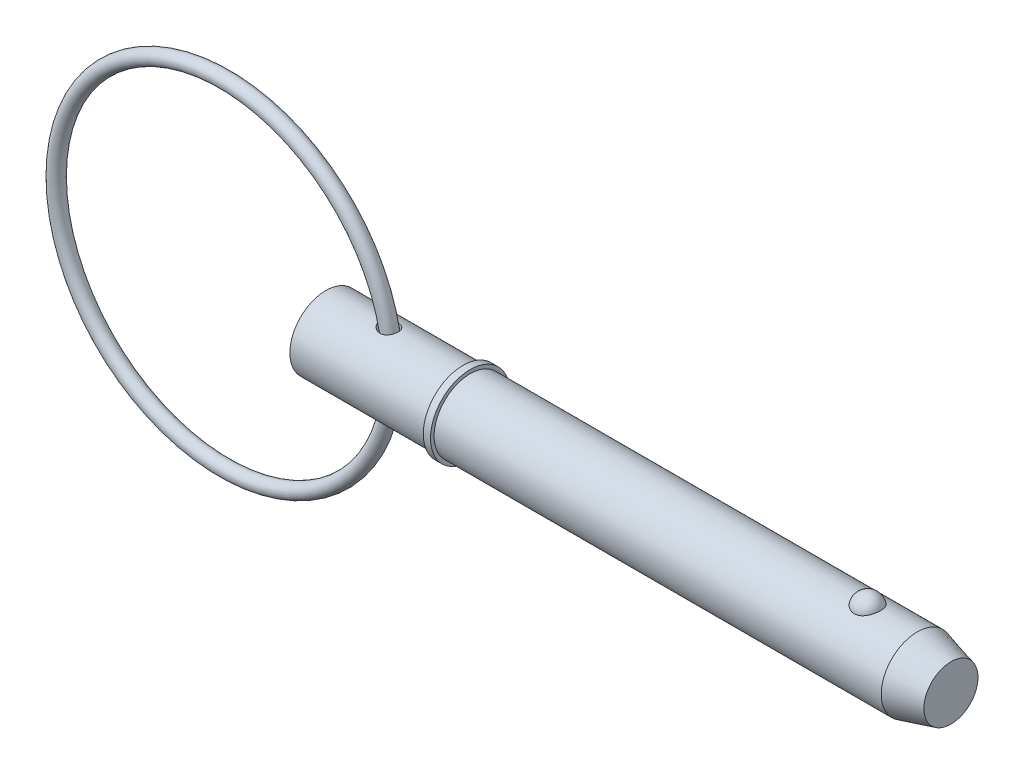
ISO-10303-21;
HEADER;
FILE_DESCRIPTION(('STEP AP214'),'2;1');
FILE_NAME('part.step','',(''),(''),'','','');
FILE_SCHEMA(('AUTOMOTIVE_DESIGN { 1 0 10303 214 1 1 1 1 }'));
ENDSEC;
DATA;
#1=APPLICATION_CONTEXT('core data for automotive mechanical design processes');
#2=APPLICATION_PROTOCOL_DEFINITION('international standard','automotive_design',2000,#1);
#3=PRODUCT_CONTEXT('',#1,'mechanical');
#4=PRODUCT('Part','Part','',(#3));
#5=PRODUCT_RELATED_PRODUCT_CATEGORY('part','',(#4));
#6=PRODUCT_DEFINITION_FORMATION('','',#4);
#7=PRODUCT_DEFINITION_CONTEXT('part definition',#1,'design');
#8=PRODUCT_DEFINITION('design','',#6,#7);
#9=PRODUCT_DEFINITION_SHAPE('','',#8);
#10=(LENGTH_UNIT() NAMED_UNIT(*) SI_UNIT(.MILLI.,.METRE.));
#11=(NAMED_UNIT(*) PLANE_ANGLE_UNIT() SI_UNIT($,.RADIAN.));
#12=(NAMED_UNIT(*) SI_UNIT($,.STERADIAN.) SOLID_ANGLE_UNIT());
#13=UNCERTAINTY_MEASURE_WITH_UNIT(LENGTH_MEASURE(1.E-05),#10,'distance_accuracy_value','');
#14=(GEOMETRIC_REPRESENTATION_CONTEXT(3) GLOBAL_UNCERTAINTY_ASSIGNED_CONTEXT((#13)) GLOBAL_UNIT_ASSIGNED_CONTEXT((#10,
#11,#12)) REPRESENTATION_CONTEXT('',''));
#15=CARTESIAN_POINT('',(0.,0.,0.));
#16=DIRECTION('',(0.,0.,1.));
#17=DIRECTION('',(1.,0.,0.));
#18=AXIS2_PLACEMENT_3D('',#15,#16,#17);
#19=CARTESIAN_POINT('',(-13.4013067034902,0.,0.));
#20=DIRECTION('',(0.,0.,1.));
#21=DIRECTION('',(1.,0.,0.));
#22=AXIS2_PLACEMENT_3D('',#19,#20,#21);
#23=TOROIDAL_SURFACE('',#22,22.225,0.952999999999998);
#24=CARTESIAN_POINT('',(9.77669329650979,0.,0.));
#25=VERTEX_POINT('',#24);
#26=VERTEX_LOOP('',#25);
#27=FACE_BOUND('',#26,.T.);
#28=ADVANCED_FACE('P0_F12',(#27),#23,.T.);
#29=CLOSED_SHELL('',(#28));
#30=MANIFOLD_SOLID_BREP('P0_B1',#29);
#31=CARTESIAN_POINT('',(0.,0.,0.));
#32=DIRECTION('',(1.,0.,0.));
#33=DIRECTION('',(0.,0.,-1.));
#34=AXIS2_PLACEMENT_3D('',#31,#32,#33);
#35=CYLINDRICAL_SURFACE('',#34,4.765);
#36=CARTESIAN_POINT('',(7.31773584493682,4.71580709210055,-0.682926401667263));
#37=CARTESIAN_POINT('',(7.3607471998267,4.70750812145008,-0.740230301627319));
#38=CARTESIAN_POINT('',(7.40883112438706,4.69869300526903,-0.79371122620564));
#39=CARTESIAN_POINT('',(7.51340999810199,4.68106981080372,-0.89180043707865));
#40=CARTESIAN_POINT('',(7.56991882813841,4.67226176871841,-0.936393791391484));
#41=CARTESIAN_POINT('',(7.689548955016,4.65568581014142,-1.01560363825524));
#42=CARTESIAN_POINT('',(7.75265928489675,4.64791621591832,-1.05023633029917));
#43=CARTESIAN_POINT('',(7.88387110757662,4.6343185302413,-1.10870278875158));
#44=CARTESIAN_POINT('',(7.95197058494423,4.62848966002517,-1.13254088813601));
#45=CARTESIAN_POINT('',(8.09209413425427,4.6194749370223,-1.16877415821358));
#46=CARTESIAN_POINT('',(8.16415141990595,4.6163169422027,-1.18104886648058));
#47=CARTESIAN_POINT('',(8.30937958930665,4.61324608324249,-1.19299123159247));
#48=CARTESIAN_POINT('',(8.38255011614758,4.61333220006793,-1.19266284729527));
#49=CARTESIAN_POINT('',(8.52374186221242,4.61674026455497,-1.17939593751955));
#50=CARTESIAN_POINT('',(8.59183022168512,4.61989017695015,-1.16712781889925));
#51=CARTESIAN_POINT('',(8.72470143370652,4.62884731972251,-1.13107903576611));
#52=CARTESIAN_POINT('',(8.78948513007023,4.63465386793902,-1.10730132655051));
#53=CARTESIAN_POINT('',(8.91088768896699,4.64792402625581,-1.05016249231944));
#54=CARTESIAN_POINT('',(8.96774302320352,4.65530108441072,-1.01728198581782));
#55=CARTESIAN_POINT('',(9.07499804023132,4.67102002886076,-0.942471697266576));
#56=CARTESIAN_POINT('',(9.12539777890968,4.6793619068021,-0.900541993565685));
#57=CARTESIAN_POINT('',(9.21836221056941,4.69607497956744,-0.808868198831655));
#58=CARTESIAN_POINT('',(9.26093651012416,4.70444612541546,-0.759133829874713));
#59=CARTESIAN_POINT('',(9.33728390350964,4.72032100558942,-0.653192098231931));
#60=CARTESIAN_POINT('',(9.3710564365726,4.72782468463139,-0.596984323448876));
#61=CARTESIAN_POINT('',(9.42940600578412,4.74126034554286,-0.478808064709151));
#62=CARTESIAN_POINT('',(9.45384681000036,4.74716869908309,-0.416769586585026));
#63=CARTESIAN_POINT('',(9.49226260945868,4.75663465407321,-0.289362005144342));
#64=CARTESIAN_POINT('',(9.50623742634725,4.76019221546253,-0.22399284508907));
#65=CARTESIAN_POINT('',(9.52342004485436,4.76458450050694,-0.0914886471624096));
#66=CARTESIAN_POINT('',(9.52658321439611,4.7654079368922,-0.0243474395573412));
#67=CARTESIAN_POINT('',(9.52194012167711,4.76421136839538,0.109528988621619));
#68=CARTESIAN_POINT('',(9.51413380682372,4.7621913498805,0.176264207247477));
#69=CARTESIAN_POINT('',(9.48775485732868,4.75552896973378,0.307367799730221));
#70=CARTESIAN_POINT('',(9.4691926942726,4.75088915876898,0.371738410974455));
#71=CARTESIAN_POINT('',(9.42175836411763,4.73949008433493,0.496364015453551));
#72=CARTESIAN_POINT('',(9.39288586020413,4.73273075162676,0.556618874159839));
#73=CARTESIAN_POINT('',(9.32549385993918,4.71782154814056,0.671371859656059));
#74=CARTESIAN_POINT('',(9.28696367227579,4.70967013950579,0.725863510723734));
#75=CARTESIAN_POINT('',(9.20123305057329,4.6928883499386,0.827453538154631));
#76=CARTESIAN_POINT('',(9.15403300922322,4.68425799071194,0.874552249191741));
#77=CARTESIAN_POINT('',(9.05250467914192,4.66754854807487,0.959736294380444));
#78=CARTESIAN_POINT('',(8.99822095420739,4.65946646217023,0.997874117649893));
#79=CARTESIAN_POINT('',(8.88381123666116,4.64472049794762,1.06440739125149));
#80=CARTESIAN_POINT('',(8.82368614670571,4.63805640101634,1.09280434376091));
#81=CARTESIAN_POINT('',(8.70022952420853,4.62698068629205,1.13878427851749));
#82=CARTESIAN_POINT('',(8.63695594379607,4.62253830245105,1.15651569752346));
#83=CARTESIAN_POINT('',(8.50825296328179,4.61622454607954,1.18146656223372));
#84=CARTESIAN_POINT('',(8.44282353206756,4.61435321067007,1.18868585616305));
#85=CARTESIAN_POINT('',(8.31119087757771,4.61332122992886,1.19268442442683));
#86=CARTESIAN_POINT('',(8.24498542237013,4.61417920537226,1.18939198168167));
#87=CARTESIAN_POINT('',(8.11397487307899,4.61847671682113,1.17259121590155));
#88=CARTESIAN_POINT('',(8.04917011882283,4.62191687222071,1.15908044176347));
#89=CARTESIAN_POINT('',(7.91946226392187,4.63117528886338,1.12153047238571));
#90=CARTESIAN_POINT('',(7.85470460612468,4.6371000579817,1.09701575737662));
#91=CARTESIAN_POINT('',(7.7300035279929,4.65063246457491,1.03814807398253));
#92=CARTESIAN_POINT('',(7.67006197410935,4.65824075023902,1.00379131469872));
#93=CARTESIAN_POINT('',(7.55352765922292,4.67473656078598,0.924015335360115));
#94=CARTESIAN_POINT('',(7.49726947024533,4.68366994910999,0.878115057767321));
#95=CARTESIAN_POINT('',(7.39344083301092,4.70144936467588,0.777311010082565));
#96=CARTESIAN_POINT('',(7.34587087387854,4.71029538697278,0.722406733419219));
#97=CARTESIAN_POINT('',(7.26188955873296,4.72669773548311,0.605773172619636));
#98=CARTESIAN_POINT('',(7.22531316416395,4.73427229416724,0.544165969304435));
#99=CARTESIAN_POINT('',(7.16406269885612,4.74732663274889,0.415095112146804));
#100=CARTESIAN_POINT('',(7.13937848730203,4.75280819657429,0.347636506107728));
#101=CARTESIAN_POINT('',(7.10494917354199,4.7605495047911,0.215359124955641));
#102=CARTESIAN_POINT('',(7.09405441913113,4.76305589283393,0.150853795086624));
#103=CARTESIAN_POINT('',(7.08387189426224,4.76539656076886,0.0208839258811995));
#104=CARTESIAN_POINT('',(7.0845805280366,4.76523166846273,-0.0445803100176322));
#105=CARTESIAN_POINT('',(7.09709111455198,4.76236014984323,-0.169693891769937));
#106=CARTESIAN_POINT('',(7.10810913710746,4.75983315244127,-0.229428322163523));
#107=CARTESIAN_POINT('',(7.13959099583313,4.75276726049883,-0.346187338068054));
#108=CARTESIAN_POINT('',(7.16004881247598,4.7482296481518,-0.403213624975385));
#109=CARTESIAN_POINT('',(7.20270325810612,4.73907067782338,-0.498040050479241));
#110=CARTESIAN_POINT('',(7.22286864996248,4.73481668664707,-0.536809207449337));
#111=CARTESIAN_POINT('',(7.26730952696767,4.72570777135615,-0.611832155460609));
#112=CARTESIAN_POINT('',(7.29158512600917,4.72085283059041,-0.64808587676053));
#113=CARTESIAN_POINT('',(7.31773584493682,4.71580709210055,-0.682926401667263));
#114=B_SPLINE_CURVE_WITH_KNOTS('',3,(#36,#37,#38,#39,#40,#41,#42,#43,#44,#45,#46,#47,#48,#49,
#50,#51,#52,#53,#54,#55,#56,#57,#58,#59,#60,#61,#62,#63,#64,#65,#66,#67,#68,#69,#70,#71,#72,#73,
#74,#75,#76,#77,#78,#79,#80,#81,#82,#83,#84,#85,#86,#87,#88,#89,#90,#91,#92,#93,#94,#95,#96,#97,
#98,#99,#100,#101,#102,#103,#104,#105,#106,#107,#108,#109,#110,#111,#112,#113),.UNSPECIFIED.,
.T.,.F.,(4,2,2,2,2,2,2,2,2,2,2,2,2,2,2,2,2,2,2,2,2,2,2,2,2,2,2,2,2,2,2,2,2,2,2,2,2,2,4),(0.,
0.216219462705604,0.432799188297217,0.649024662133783,0.865163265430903,1.08352938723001,
1.30182691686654,1.50853487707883,1.71518978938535,1.91252381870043,2.1098561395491,
2.30694457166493,2.50404555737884,2.70392296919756,2.90380378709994,3.10450875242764,
3.30521468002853,3.5057255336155,3.70624293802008,3.90698330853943,4.10771458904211,
4.30723900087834,4.50673262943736,4.70338139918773,4.90003300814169,5.09802914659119,
5.29607279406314,5.5036500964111,5.7113074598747,5.92972727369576,6.14815938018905,
6.36312650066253,6.57790998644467,6.77325899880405,6.96854747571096,7.15009726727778,
7.33153144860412,7.46298830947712,7.59444881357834),.UNSPECIFIED.);
#115=CARTESIAN_POINT('',(7.31773584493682,4.71580709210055,-0.682926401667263));
#116=VERTEX_POINT('',#115);
#117=EDGE_CURVE('P1_E42',#116,#116,#114,.T.);
#118=ORIENTED_EDGE('',*,*,#117,.T.);
#119=EDGE_LOOP('',(#118));
#120=FACE_BOUND('',#119,.T.);
#121=CARTESIAN_POINT('',(0.,0.,0.));
#122=DIRECTION('',(1.,0.,0.));
#123=DIRECTION('',(0.,0.,-1.));
#124=AXIS2_PLACEMENT_3D('',#121,#122,#123);
#125=CIRCLE('',#124,4.765);
#126=CARTESIAN_POINT('',(0.,0.,-4.765));
#127=VERTEX_POINT('',#126);
#128=EDGE_CURVE('P1_E9',#127,#127,#125,.T.);
#129=ORIENTED_EDGE('',*,*,#128,.T.);
#130=EDGE_LOOP('',(#129));
#131=FACE_BOUND('',#130,.T.);
#132=CARTESIAN_POINT('',(18.097,0.,0.));
#133=DIRECTION('',(1.,0.,0.));
#134=DIRECTION('',(0.,0.,-1.));
#135=AXIS2_PLACEMENT_3D('',#132,#133,#134);
#136=CIRCLE('',#135,4.765);
#137=CARTESIAN_POINT('',(18.097,0.,-4.765));
#138=VERTEX_POINT('',#137);
#139=EDGE_CURVE('P1_E25',#138,#138,#136,.T.);
#140=ORIENTED_EDGE('',*,*,#139,.F.);
#141=EDGE_LOOP('',(#140));
#142=FACE_BOUND('',#141,.T.);
#143=CARTESIAN_POINT('',(7.31773584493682,-4.71580709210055,-0.682926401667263));
#144=CARTESIAN_POINT('',(7.27956054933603,-4.72317282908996,-0.63206220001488));
#145=CARTESIAN_POINT('',(7.24535712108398,-4.7301361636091,-0.578155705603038));
#146=CARTESIAN_POINT('',(7.18611785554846,-4.74256090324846,-0.465352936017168));
#147=CARTESIAN_POINT('',(7.16107836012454,-4.74802290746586,-0.406458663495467));
#148=CARTESIAN_POINT('',(7.12119149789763,-4.75686558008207,-0.284913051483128));
#149=CARTESIAN_POINT('',(7.1063796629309,-4.76023898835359,-0.222249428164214));
#150=CARTESIAN_POINT('',(7.08786546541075,-4.76447177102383,-0.0952170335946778));
#151=CARTESIAN_POINT('',(7.08416018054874,-4.76533180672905,-0.0308487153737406));
#152=CARTESIAN_POINT('',(7.08795686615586,-4.76445764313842,0.0942755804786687));
#153=CARTESIAN_POINT('',(7.09490366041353,-4.762851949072,0.155050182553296));
#154=CARTESIAN_POINT('',(7.11863973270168,-4.75746086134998,0.2745356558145));
#155=CARTESIAN_POINT('',(7.13542953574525,-4.75367535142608,0.333246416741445));
#156=CARTESIAN_POINT('',(7.17817193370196,-4.74430545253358,0.447305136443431));
#157=CARTESIAN_POINT('',(7.20415836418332,-4.73871442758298,0.502639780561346));
#158=CARTESIAN_POINT('',(7.26428068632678,-4.72628508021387,0.608523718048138));
#159=CARTESIAN_POINT('',(7.29841897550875,-4.71944639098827,0.659071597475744));
#160=CARTESIAN_POINT('',(7.37680984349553,-4.70456239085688,0.758311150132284));
#161=CARTESIAN_POINT('',(7.42165519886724,-4.69646426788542,0.806526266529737));
#162=CARTESIAN_POINT('',(7.51828933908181,-4.68032890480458,0.895428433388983));
#163=CARTESIAN_POINT('',(7.57008134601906,-4.67229169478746,0.936111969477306));
#164=CARTESIAN_POINT('',(7.68397204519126,-4.65640659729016,1.01229731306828));
#165=CARTESIAN_POINT('',(7.74657226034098,-4.64863251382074,1.04706751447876));
#166=CARTESIAN_POINT('',(7.87680110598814,-4.6349740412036,1.10596507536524));
#167=CARTESIAN_POINT('',(7.94443054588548,-4.62908995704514,1.13009071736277));
#168=CARTESIAN_POINT('',(8.08402017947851,-4.61989019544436,1.16713943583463));
#169=CARTESIAN_POINT('',(8.15603143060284,-4.61661596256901,1.17988211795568));
#170=CARTESIAN_POINT('',(8.30124697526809,-4.61330446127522,1.1927680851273));
#171=CARTESIAN_POINT('',(8.37445077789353,-4.61326589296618,1.19291642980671));
#172=CARTESIAN_POINT('',(8.51584800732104,-4.61644036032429,1.18056687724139));
#173=CARTESIAN_POINT('',(8.58410302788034,-4.61948317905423,1.16873099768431));
#174=CARTESIAN_POINT('',(8.71738052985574,-4.6282520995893,1.13350536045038));
#175=CARTESIAN_POINT('',(8.78240382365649,-4.63397752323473,1.11011852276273));
#176=CARTESIAN_POINT('',(8.90428519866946,-4.64711877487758,1.05371003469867));
#177=CARTESIAN_POINT('',(8.96138096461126,-4.6544450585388,1.02117932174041));
#178=CARTESIAN_POINT('',(9.06916653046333,-4.6700970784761,0.947021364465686));
#179=CARTESIAN_POINT('',(9.11985639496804,-4.67842280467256,0.905394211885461));
#180=CARTESIAN_POINT('',(9.2134071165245,-4.69513303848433,0.814300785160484));
#181=CARTESIAN_POINT('',(9.25628268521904,-4.70351740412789,0.764849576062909));
#182=CARTESIAN_POINT('',(9.33327173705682,-4.71945185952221,0.659422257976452));
#183=CARTESIAN_POINT('',(9.3673846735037,-4.72700189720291,0.603445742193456));
#184=CARTESIAN_POINT('',(9.42645214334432,-4.74055953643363,0.485673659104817));
#185=CARTESIAN_POINT('',(9.45127042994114,-4.74654383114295,0.423807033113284));
#186=CARTESIAN_POINT('',(9.49046298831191,-4.756182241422,0.296676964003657));
#187=CARTESIAN_POINT('',(9.50483706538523,-4.75983631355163,0.231413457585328));
#188=CARTESIAN_POINT('',(9.52283408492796,-4.76443282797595,0.0990368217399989));
#189=CARTESIAN_POINT('',(9.52641016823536,-4.76536345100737,0.0319169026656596));
#190=CARTESIAN_POINT('',(9.52259067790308,-4.76437893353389,-0.101988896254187));
#191=CARTESIAN_POINT('',(9.5151950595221,-4.76246378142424,-0.168774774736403));
#192=CARTESIAN_POINT('',(9.48962516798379,-4.75599746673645,-0.300048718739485));
#193=CARTESIAN_POINT('',(9.4714615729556,-4.75144891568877,-0.364538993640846));
#194=CARTESIAN_POINT('',(9.42480303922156,-4.74020887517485,-0.489470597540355));
#195=CARTESIAN_POINT('',(9.396307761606,-4.73351731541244,-0.549911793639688));
#196=CARTESIAN_POINT('',(9.32963953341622,-4.71871240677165,-0.665099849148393));
#197=CARTESIAN_POINT('',(9.29145577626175,-4.71059747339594,-0.719840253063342));
#198=CARTESIAN_POINT('',(9.20637695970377,-4.69385254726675,-0.82198328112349));
#199=CARTESIAN_POINT('',(9.15948227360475,-4.68522257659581,-0.869386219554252));
#200=CARTESIAN_POINT('',(9.05849937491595,-4.66847516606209,-0.955233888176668));
#201=CARTESIAN_POINT('',(9.00445430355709,-4.6603550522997,-0.993728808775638));
#202=CARTESIAN_POINT('',(8.8904576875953,-4.64550122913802,-1.06100691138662));
#203=CARTESIAN_POINT('',(8.83050704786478,-4.63876730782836,-1.08979157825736));
#204=CARTESIAN_POINT('',(8.70732873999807,-4.6275305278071,-1.13655620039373));
#205=CARTESIAN_POINT('',(8.64416019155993,-4.62299714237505,-1.15468477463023));
#206=CARTESIAN_POINT('',(8.51559711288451,-4.61649071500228,-1.18043067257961));
#207=CARTESIAN_POINT('',(8.4502025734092,-4.61451768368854,-1.18804795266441));
#208=CARTESIAN_POINT('',(8.31862013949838,-4.61328355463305,-1.19283094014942));
#209=CARTESIAN_POINT('',(8.25242983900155,-4.61403911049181,-1.18993246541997));
#210=CARTESIAN_POINT('',(8.12138461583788,-4.61814057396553,-1.17391149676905));
#211=CARTESIAN_POINT('',(8.0565300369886,-4.62148714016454,-1.16078640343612));
#212=CARTESIAN_POINT('',(7.92669960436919,-4.63056912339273,-1.12402333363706));
#213=CARTESIAN_POINT('',(7.86186447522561,-4.63641051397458,-1.09991536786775));
#214=CARTESIAN_POINT('',(7.73694230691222,-4.64980121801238,-1.04185298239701));
#215=CARTESIAN_POINT('',(7.6768568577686,-4.65735110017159,-1.0078952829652));
#216=CARTESIAN_POINT('',(7.56207884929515,-4.67346080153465,-0.930364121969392));
#217=CARTESIAN_POINT('',(7.5074784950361,-4.68203382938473,-0.886656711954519));
#218=CARTESIAN_POINT('',(7.40624045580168,-4.69916824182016,-0.79082583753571));
#219=CARTESIAN_POINT('',(7.35959988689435,-4.7077296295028,-0.738705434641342));
#220=CARTESIAN_POINT('',(7.31773584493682,-4.71580709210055,-0.682926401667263));
#221=B_SPLINE_CURVE_WITH_KNOTS('',3,(#143,#144,#145,#146,#147,#148,#149,#150,#151,#152,#153,
#154,#155,#156,#157,#158,#159,#160,#161,#162,#163,#164,#165,#166,#167,#168,#169,#170,#171,#172,
#173,#174,#175,#176,#177,#178,#179,#180,#181,#182,#183,#184,#185,#186,#187,#188,#189,#190,#191,
#192,#193,#194,#195,#196,#197,#198,#199,#200,#201,#202,#203,#204,#205,#206,#207,#208,#209,#210,
#211,#212,#213,#214,#215,#216,#217,#218,#219,#220),.UNSPECIFIED.,.T.,.F.,(4,2,2,2,2,2,2,2,2,2,2,
2,2,2,2,2,2,2,2,2,2,2,2,2,2,2,2,2,2,2,2,2,2,2,2,2,2,2,4),(0.,0.191851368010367,0.38362606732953,
0.576063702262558,0.768450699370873,0.951145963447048,1.13385097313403,1.31723528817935,
1.50067360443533,1.69887079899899,1.8971602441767,2.11225870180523,2.32739185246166,
2.54587681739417,2.76427400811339,2.97123130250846,3.17813630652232,3.37555441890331,
3.57297054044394,3.77001106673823,3.96706388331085,4.16690159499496,4.36674303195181,
4.56745046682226,4.76815872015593,4.96866827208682,5.16918440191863,5.36992517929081,
5.5706573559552,5.77022940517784,5.96977092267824,6.16645904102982,6.36314797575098,
6.56103940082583,6.75898114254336,6.96633026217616,7.17374850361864,7.384214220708,
7.59460352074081),.UNSPECIFIED.);
#222=CARTESIAN_POINT('',(7.31773584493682,-4.71580709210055,-0.682926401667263));
#223=VERTEX_POINT('',#222);
#224=EDGE_CURVE('P1_E17',#223,#223,#221,.T.);
#225=ORIENTED_EDGE('',*,*,#224,.T.);
#226=EDGE_LOOP('',(#225));
#227=FACE_BOUND('',#226,.T.);
#228=ADVANCED_FACE('P1_F13',(#120,#131,#142,#227),#35,.T.);
#229=CARTESIAN_POINT('',(0.,0.,0.));
#230=DIRECTION('',(1.,0.,0.));
#231=DIRECTION('',(0.,0.,-1.));
#232=AXIS2_PLACEMENT_3D('',#229,#230,#231);
#233=CYLINDRICAL_SURFACE('',#232,4.765);
#234=CARTESIAN_POINT('',(78.1041944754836,0.,0.));
#235=DIRECTION('',(1.,0.,0.));
#236=DIRECTION('',(0.,0.,-1.));
#237=AXIS2_PLACEMENT_3D('',#234,#235,#236);
#238=CIRCLE('',#237,4.765);
#239=CARTESIAN_POINT('',(78.1041944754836,0.,-4.765));
#240=VERTEX_POINT('',#239);
#241=EDGE_CURVE('P1_E99',#240,#240,#238,.T.);
#242=ORIENTED_EDGE('',*,*,#241,.F.);
#243=EDGE_LOOP('',(#242));
#244=FACE_BOUND('',#243,.T.);
#245=CARTESIAN_POINT('',(19.05,0.,0.));
#246=DIRECTION('',(1.,0.,0.));
#247=DIRECTION('',(0.,0.,-1.));
#248=AXIS2_PLACEMENT_3D('',#245,#246,#247);
#249=CIRCLE('',#248,4.765);
#250=CARTESIAN_POINT('',(19.05,0.,-4.765));
#251=VERTEX_POINT('',#250);
#252=EDGE_CURVE('P1_E96',#251,#251,#249,.T.);
#253=ORIENTED_EDGE('',*,*,#252,.T.);
#254=EDGE_LOOP('',(#253));
#255=FACE_BOUND('',#254,.T.);
#256=CARTESIAN_POINT('',(71.551020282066,4.42764777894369,1.76101111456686));
#257=CARTESIAN_POINT('',(71.4597212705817,4.42764470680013,1.76101422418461));
#258=CARTESIAN_POINT('',(71.3684468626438,4.4305909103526,1.75366340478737));
#259=CARTESIAN_POINT('',(71.1886154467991,4.44201846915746,1.72451180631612));
#260=CARTESIAN_POINT('',(71.1000577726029,4.45049845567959,1.702714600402));
#261=CARTESIAN_POINT('',(70.9282570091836,4.47200516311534,1.64539370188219));
#262=CARTESIAN_POINT('',(70.8450064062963,4.48502527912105,1.60988994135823));
#263=CARTESIAN_POINT('',(70.6857633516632,4.51419542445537,1.52617873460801));
#264=CARTESIAN_POINT('',(70.6097723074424,4.53034605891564,1.47796883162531));
#265=CARTESIAN_POINT('',(70.4647445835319,4.5645931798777,1.36860494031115));
#266=CARTESIAN_POINT('',(70.3959645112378,4.58273170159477,1.30712420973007));
#267=CARTESIAN_POINT('',(70.2693423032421,4.61870302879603,1.17370204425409));
#268=CARTESIAN_POINT('',(70.2115021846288,4.63653577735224,1.10175868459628));
#269=CARTESIAN_POINT('',(70.105570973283,4.67090140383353,0.94580676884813));
#270=CARTESIAN_POINT('',(70.0580305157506,4.68734068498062,0.86140291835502));
#271=CARTESIAN_POINT('',(69.9770817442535,4.71628466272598,0.685442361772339));
#272=CARTESIAN_POINT('',(69.9436747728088,4.72878898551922,0.593884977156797));
#273=CARTESIAN_POINT('',(69.891287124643,4.74874061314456,0.404781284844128));
#274=CARTESIAN_POINT('',(69.8725178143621,4.75611366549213,0.307168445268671));
#275=CARTESIAN_POINT('',(69.8505846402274,4.76475393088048,0.109940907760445));
#276=CARTESIAN_POINT('',(69.8474205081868,4.76602124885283,0.0103262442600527));
#277=CARTESIAN_POINT('',(69.8567405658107,4.76232928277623,-0.187629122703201));
#278=CARTESIAN_POINT('',(69.8691588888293,4.7573962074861,-0.285973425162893));
#279=CARTESIAN_POINT('',(69.9092804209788,4.74184975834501,-0.479027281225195));
#280=CARTESIAN_POINT('',(69.9369839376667,4.7312362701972,-0.573736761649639));
#281=CARTESIAN_POINT('',(70.0071581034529,4.70540026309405,-0.756973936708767));
#282=CARTESIAN_POINT('',(70.0496460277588,4.69017235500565,-0.845494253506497));
#283=CARTESIAN_POINT('',(70.148520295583,4.6566986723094,-1.01378033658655));
#284=CARTESIAN_POINT('',(70.2049076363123,4.63845268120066,-1.09354547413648));
#285=CARTESIAN_POINT('',(70.330552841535,4.60085438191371,-1.24228523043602));
#286=CARTESIAN_POINT('',(70.3998439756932,4.58149930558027,-1.31123108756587));
#287=CARTESIAN_POINT('',(70.5496066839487,4.54391653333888,-1.43607409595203));
#288=CARTESIAN_POINT('',(70.6300771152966,4.52568872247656,-1.49197257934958));
#289=CARTESIAN_POINT('',(70.7981500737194,4.49293007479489,-1.58786764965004));
#290=CARTESIAN_POINT('',(70.8855445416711,4.47832346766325,-1.62820219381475));
#291=CARTESIAN_POINT('',(71.066553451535,4.45406011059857,-1.69345757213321));
#292=CARTESIAN_POINT('',(71.1601655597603,4.44440151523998,-1.71838415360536));
#293=CARTESIAN_POINT('',(71.3458939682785,4.43159888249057,-1.7511284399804));
#294=CARTESIAN_POINT('',(71.437849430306,4.42815213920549,-1.75974223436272));
#295=CARTESIAN_POINT('',(71.6219658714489,4.42724735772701,-1.76201865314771));
#296=CARTESIAN_POINT('',(71.7141268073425,4.42978816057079,-1.75568417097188));
#297=CARTESIAN_POINT('',(71.8931292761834,4.4403864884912,-1.72869560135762));
#298=CARTESIAN_POINT('',(71.9800474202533,4.44827555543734,-1.7084785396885));
#299=CARTESIAN_POINT('',(72.1491314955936,4.46852246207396,-1.6547956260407));
#300=CARTESIAN_POINT('',(72.2312970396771,4.4808806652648,-1.62132869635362));
#301=CARTESIAN_POINT('',(72.3905916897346,4.50907357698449,-1.54120560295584));
#302=CARTESIAN_POINT('',(72.4675700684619,4.52497884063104,-1.49427526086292));
#303=CARTESIAN_POINT('',(72.6127080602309,4.55845148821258,-1.38881222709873));
#304=CARTESIAN_POINT('',(72.6808656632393,4.57601924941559,-1.33027689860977));
#305=CARTESIAN_POINT('',(72.8100990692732,4.61196537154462,-1.19991049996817));
#306=CARTESIAN_POINT('',(72.8706562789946,4.63034074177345,-1.12756415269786));
#307=CARTESIAN_POINT('',(72.9792797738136,4.66513959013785,-0.973612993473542));
#308=CARTESIAN_POINT('',(73.0273438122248,4.68156271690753,-0.892006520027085));
#309=CARTESIAN_POINT('',(73.111383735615,4.71130224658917,-0.718892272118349));
#310=CARTESIAN_POINT('',(73.1469185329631,4.724501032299,-0.627149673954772));
#311=CARTESIAN_POINT('',(73.2029522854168,4.74571823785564,-0.438611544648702));
#312=CARTESIAN_POINT('',(73.223450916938,4.75373654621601,-0.341815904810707));
#313=CARTESIAN_POINT('',(73.2490338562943,4.76378905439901,-0.145633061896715));
#314=CARTESIAN_POINT('',(73.254076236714,4.76580697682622,-0.0462395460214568));
#315=CARTESIAN_POINT('',(73.2485239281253,4.7636057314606,0.152038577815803));
#316=CARTESIAN_POINT('',(73.2379294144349,4.75938663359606,0.250923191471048));
#317=CARTESIAN_POINT('',(73.2013875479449,4.74516937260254,0.445004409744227));
#318=CARTESIAN_POINT('',(73.1754964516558,4.73519238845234,0.540213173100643));
#319=CARTESIAN_POINT('',(73.1089273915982,4.7104939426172,0.724662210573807));
#320=CARTESIAN_POINT('',(73.068248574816,4.69577220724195,0.813902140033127));
#321=CARTESIAN_POINT('',(72.9727177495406,4.66303767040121,0.984313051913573));
#322=CARTESIAN_POINT('',(72.9178042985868,4.64501070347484,1.06544688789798));
#323=CARTESIAN_POINT('',(72.7950496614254,4.60764678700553,1.21692673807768));
#324=CARTESIAN_POINT('',(72.7272086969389,4.58830985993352,1.2872729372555));
#325=CARTESIAN_POINT('',(72.5805480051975,4.55060370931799,1.41479271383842));
#326=CARTESIAN_POINT('',(72.5017918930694,4.53222967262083,1.4720378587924));
#327=CARTESIAN_POINT('',(72.3349890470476,4.49849576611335,1.57212016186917));
#328=CARTESIAN_POINT('',(72.2469417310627,4.48313608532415,1.6149564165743));
#329=CARTESIAN_POINT('',(72.0597918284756,4.45676184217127,1.68642657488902));
#330=CARTESIAN_POINT('',(71.9603653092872,4.44598302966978,1.71430590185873));
#331=CARTESIAN_POINT('',(71.7576210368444,4.43142918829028,1.75159258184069));
#332=CARTESIAN_POINT('',(71.6543049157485,4.42765125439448,1.76100759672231));
#333=CARTESIAN_POINT('',(71.551020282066,4.42764777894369,1.76101111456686));
#334=B_SPLINE_CURVE_WITH_KNOTS('',3,(#256,#257,#258,#259,#260,#261,#262,#263,#264,#265,#266,
#267,#268,#269,#270,#271,#272,#273,#274,#275,#276,#277,#278,#279,#280,#281,#282,#283,#284,#285,
#286,#287,#288,#289,#290,#291,#292,#293,#294,#295,#296,#297,#298,#299,#300,#301,#302,#303,#304,
#305,#306,#307,#308,#309,#310,#311,#312,#313,#314,#315,#316,#317,#318,#319,#320,#321,#322,#323,
#324,#325,#326,#327,#328,#329,#330,#331,#332,#333),.UNSPECIFIED.,.T.,.F.,(4,2,2,2,2,2,2,2,2,2,2,
2,2,2,2,2,2,2,2,2,2,2,2,2,2,2,2,2,2,2,2,2,2,2,2,2,2,2,4),(0.,0.273517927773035,
0.546968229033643,0.820022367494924,1.09312934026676,1.37393946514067,1.65480131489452,
1.94820420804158,2.24163496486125,2.53922817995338,2.83681628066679,3.13315071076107,
3.42949110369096,3.72617893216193,4.02288805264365,4.32037303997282,4.61782764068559,
4.90840095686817,5.19886582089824,5.47474855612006,5.75057789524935,6.01809977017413,
6.28564340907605,6.55907787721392,6.83257454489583,7.11962987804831,7.40673679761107,
7.7031266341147,7.99952284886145,8.2967223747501,8.59391856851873,8.89002850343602,
9.18615552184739,9.48358266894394,9.78100471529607,10.0767610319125,10.3725358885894,
10.6820893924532,10.9915144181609),.UNSPECIFIED.);
#335=CARTESIAN_POINT('',(71.551020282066,4.42764777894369,1.76101111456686));
#336=VERTEX_POINT('',#335);
#337=EDGE_CURVE('P1_E34',#336,#336,#334,.T.);
#338=ORIENTED_EDGE('',*,*,#337,.T.);
#339=EDGE_LOOP('',(#338));
#340=FACE_BOUND('',#339,.T.);
#341=ADVANCED_FACE('P1_F46',(#244,#255,#340),#233,.T.);
#342=CARTESIAN_POINT('',(0.,0.,0.));
#343=DIRECTION('',(-1.,0.,0.));
#344=DIRECTION('',(0.,0.,1.));
#345=AXIS2_PLACEMENT_3D('',#342,#343,#344);
#346=PLANE('',#345);
#347=ORIENTED_EDGE('',*,*,#128,.F.);
#348=EDGE_LOOP('',(#347));
#349=FACE_BOUND('',#348,.T.);
#350=ADVANCED_FACE('P1_F15',(#349),#346,.T.);
#351=CARTESIAN_POINT('',(18.097,4.765,0.));
#352=DIRECTION('',(-1.,0.,0.));
#353=DIRECTION('',(0.,0.,1.));
#354=AXIS2_PLACEMENT_3D('',#351,#352,#353);
#355=PLANE('',#354);
#356=ORIENTED_EDGE('',*,*,#139,.T.);
#357=EDGE_LOOP('',(#356));
#358=FACE_BOUND('',#357,.T.);
#359=CARTESIAN_POINT('',(18.097,0.,0.));
#360=DIRECTION('',(1.,0.,0.));
#361=DIRECTION('',(0.,0.,-1.));
#362=AXIS2_PLACEMENT_3D('',#359,#360,#361);
#363=CIRCLE('',#362,5.2415);
#364=CARTESIAN_POINT('',(18.097,0.,-5.2415));
#365=VERTEX_POINT('',#364);
#366=EDGE_CURVE('P1_E30',#365,#365,#363,.T.);
#367=ORIENTED_EDGE('',*,*,#366,.F.);
#368=EDGE_LOOP('',(#367));
#369=FACE_BOUND('',#368,.T.);
#370=ADVANCED_FACE('P1_F81',(#358,#369),#355,.T.);
#371=CARTESIAN_POINT('',(0.,0.,0.));
#372=DIRECTION('',(1.,0.,0.));
#373=DIRECTION('',(0.,0.,-1.));
#374=AXIS2_PLACEMENT_3D('',#371,#372,#373);
#375=CYLINDRICAL_SURFACE('',#374,5.2415);
#376=ORIENTED_EDGE('',*,*,#366,.T.);
#377=EDGE_LOOP('',(#376));
#378=FACE_BOUND('',#377,.T.);
#379=CARTESIAN_POINT('',(19.05,0.,0.));
#380=DIRECTION('',(1.,0.,0.));
#381=DIRECTION('',(0.,0.,-1.));
#382=AXIS2_PLACEMENT_3D('',#379,#380,#381);
#383=CIRCLE('',#382,5.2415);
#384=CARTESIAN_POINT('',(19.05,0.,-5.2415));
#385=VERTEX_POINT('',#384);
#386=EDGE_CURVE('P1_E95',#385,#385,#383,.T.);
#387=ORIENTED_EDGE('',*,*,#386,.F.);
#388=EDGE_LOOP('',(#387));
#389=FACE_BOUND('',#388,.T.);
#390=ADVANCED_FACE('P1_F68',(#378,#389),#375,.T.);
#391=CARTESIAN_POINT('',(19.05,5.2415,0.));
#392=DIRECTION('',(1.,0.,0.));
#393=DIRECTION('',(0.,0.,-1.));
#394=AXIS2_PLACEMENT_3D('',#391,#392,#393);
#395=PLANE('',#394);
#396=ORIENTED_EDGE('',*,*,#386,.T.);
#397=EDGE_LOOP('',(#396));
#398=FACE_BOUND('',#397,.T.);
#399=ORIENTED_EDGE('',*,*,#252,.F.);
#400=EDGE_LOOP('',(#399));
#401=FACE_BOUND('',#400,.T.);
#402=ADVANCED_FACE('P1_F62',(#398,#401),#395,.T.);
#403=CARTESIAN_POINT('',(82.55,0.,0.));
#404=DIRECTION('',(-1.,0.,0.));
#405=DIRECTION('',(0.,0.,1.));
#406=AXIS2_PLACEMENT_3D('',#403,#404,#405);
#407=CONICAL_SURFACE('',#406,3.57375000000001,0.26179938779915);
#408=ORIENTED_EDGE('',*,*,#241,.T.);
#409=EDGE_LOOP('',(#408));
#410=FACE_BOUND('',#409,.T.);
#411=CARTESIAN_POINT('',(82.55,0.,0.));
#412=DIRECTION('',(1.,0.,0.));
#413=DIRECTION('',(0.,0.,-1.));
#414=AXIS2_PLACEMENT_3D('',#411,#412,#413);
#415=CIRCLE('',#414,3.57375000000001);
#416=CARTESIAN_POINT('',(82.55,0.,-3.57375000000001));
#417=VERTEX_POINT('',#416);
#418=EDGE_CURVE('P1_E41',#417,#417,#415,.T.);
#419=ORIENTED_EDGE('',*,*,#418,.F.);
#420=EDGE_LOOP('',(#419));
#421=FACE_BOUND('',#420,.T.);
#422=ADVANCED_FACE('P1_F59',(#410,#421),#407,.T.);
#423=CARTESIAN_POINT('',(82.55,3.57375000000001,0.));
#424=DIRECTION('',(1.,0.,0.));
#425=DIRECTION('',(0.,0.,-1.));
#426=AXIS2_PLACEMENT_3D('',#423,#424,#425);
#427=PLANE('',#426);
#428=ORIENTED_EDGE('',*,*,#418,.T.);
#429=EDGE_LOOP('',(#428));
#430=FACE_BOUND('',#429,.T.);
#431=ADVANCED_FACE('P1_F55',(#430),#427,.T.);
#432=CARTESIAN_POINT('',(71.551020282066,4.2885,0.));
#433=DIRECTION('',(-1.,0.,0.));
#434=DIRECTION('',(0.,-1.,0.));
#435=AXIS2_PLACEMENT_3D('',#432,#433,#434);
#436=SPHERICAL_SURFACE('',#435,1.76649999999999);
#437=ORIENTED_EDGE('',*,*,#337,.F.);
#438=EDGE_LOOP('',(#437));
#439=FACE_BOUND('',#438,.T.);
#440=ADVANCED_FACE('P1_F50',(#439),#436,.T.);
#441=CARTESIAN_POINT('',(-13.4013067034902,0.,0.));
#442=DIRECTION('',(0.,0.,1.));
#443=DIRECTION('',(1.,0.,0.));
#444=AXIS2_PLACEMENT_3D('',#441,#442,#443);
#445=TOROIDAL_SURFACE('',#444,22.225,1.19125);
#446=ORIENTED_EDGE('',*,*,#224,.F.);
#447=EDGE_LOOP('',(#446));
#448=FACE_BOUND('',#447,.T.);
#449=ORIENTED_EDGE('',*,*,#117,.F.);
#450=EDGE_LOOP('',(#449));
#451=FACE_BOUND('',#450,.T.);
#452=ADVANCED_FACE('P1_F54',(#448,#451),#445,.F.);
#453=CLOSED_SHELL('',(#228,#341,#350,#370,#390,#402,#422,#431,#440,#452));
#454=MANIFOLD_SOLID_BREP('P1_B1',#453);
#455=ADVANCED_BREP_SHAPE_REPRESENTATION('',(#18,#30,#454),#14);
#456=SHAPE_DEFINITION_REPRESENTATION(#9,#455);
ENDSEC;
END-ISO-10303-21;
